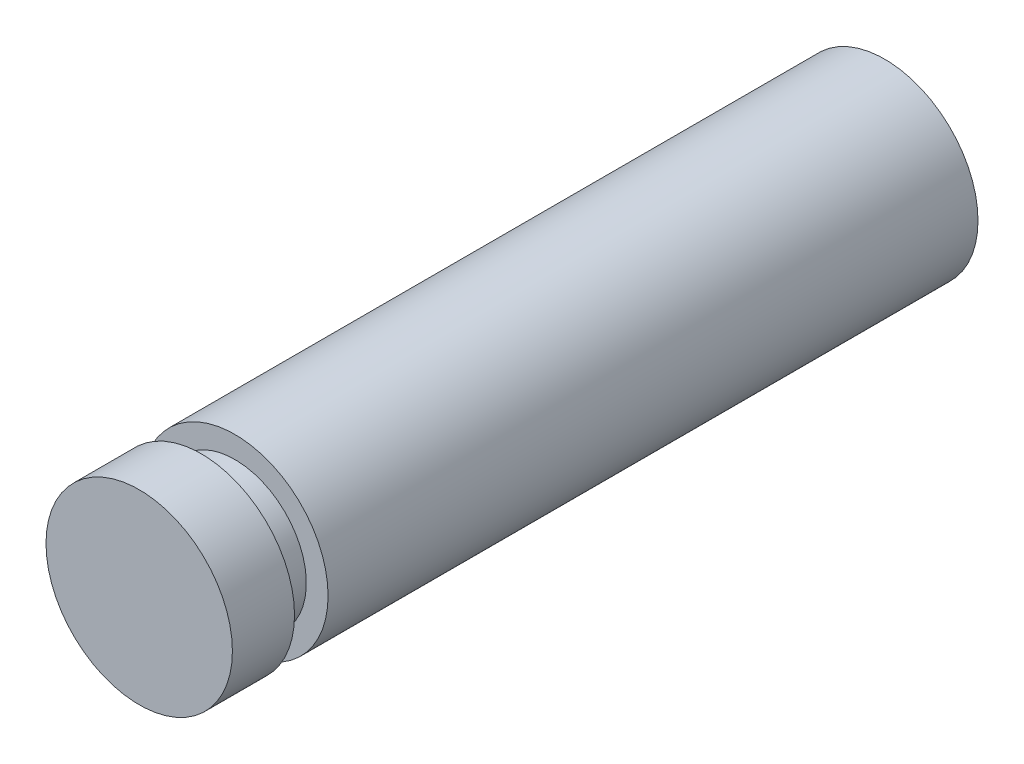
ISO-10303-21;
HEADER;
FILE_DESCRIPTION(('STEP AP214'),'2;1');
FILE_NAME('part.step','',(''),(''),'','','');
FILE_SCHEMA(('AUTOMOTIVE_DESIGN { 1 0 10303 214 1 1 1 1 }'));
ENDSEC;
DATA;
#1=APPLICATION_CONTEXT('core data for automotive mechanical design processes');
#2=APPLICATION_PROTOCOL_DEFINITION('international standard','automotive_design',2000,#1);
#3=PRODUCT_CONTEXT('',#1,'mechanical');
#4=PRODUCT('Part','Part','',(#3));
#5=PRODUCT_RELATED_PRODUCT_CATEGORY('part','',(#4));
#6=PRODUCT_DEFINITION_FORMATION('','',#4);
#7=PRODUCT_DEFINITION_CONTEXT('part definition',#1,'design');
#8=PRODUCT_DEFINITION('design','',#6,#7);
#9=PRODUCT_DEFINITION_SHAPE('','',#8);
#10=(LENGTH_UNIT() NAMED_UNIT(*) SI_UNIT(.MILLI.,.METRE.));
#11=(NAMED_UNIT(*) PLANE_ANGLE_UNIT() SI_UNIT($,.RADIAN.));
#12=(NAMED_UNIT(*) SI_UNIT($,.STERADIAN.) SOLID_ANGLE_UNIT());
#13=UNCERTAINTY_MEASURE_WITH_UNIT(LENGTH_MEASURE(1.E-05),#10,'distance_accuracy_value','');
#14=(GEOMETRIC_REPRESENTATION_CONTEXT(3) GLOBAL_UNCERTAINTY_ASSIGNED_CONTEXT((#13)) GLOBAL_UNIT_ASSIGNED_CONTEXT((#10,
#11,#12)) REPRESENTATION_CONTEXT('',''));
#15=CARTESIAN_POINT('',(0.,0.,0.));
#16=DIRECTION('',(0.,0.,1.));
#17=DIRECTION('',(1.,0.,0.));
#18=AXIS2_PLACEMENT_3D('',#15,#16,#17);
#19=CARTESIAN_POINT('',(0.,0.,12.));
#20=DIRECTION('',(0.,0.,-1.));
#21=DIRECTION('',(-1.,0.,0.));
#22=AXIS2_PLACEMENT_3D('',#19,#20,#21);
#23=CYLINDRICAL_SURFACE('',#22,1.5);
#24=CARTESIAN_POINT('',(0.,0.,12.));
#25=DIRECTION('',(0.,0.,1.));
#26=DIRECTION('',(1.,0.,0.));
#27=AXIS2_PLACEMENT_3D('',#24,#25,#26);
#28=CIRCLE('',#27,1.5);
#29=CARTESIAN_POINT('',(1.5,0.,12.));
#30=VERTEX_POINT('',#29);
#31=EDGE_CURVE('E10',#30,#30,#28,.T.);
#32=ORIENTED_EDGE('',*,*,#31,.F.);
#33=EDGE_LOOP('',(#32));
#34=FACE_BOUND('',#33,.T.);
#35=CARTESIAN_POINT('',(0.,0.,11.));
#36=DIRECTION('',(0.,0.,-1.));
#37=DIRECTION('',(-1.,0.,0.));
#38=AXIS2_PLACEMENT_3D('',#35,#36,#37);
#39=CIRCLE('',#38,1.5);
#40=CARTESIAN_POINT('',(-1.5,0.,11.));
#41=VERTEX_POINT('',#40);
#42=EDGE_CURVE('E33',#41,#41,#39,.T.);
#43=ORIENTED_EDGE('',*,*,#42,.F.);
#44=EDGE_LOOP('',(#43));
#45=FACE_BOUND('',#44,.T.);
#46=ADVANCED_FACE('F30',(#34,#45),#23,.T.);
#47=CARTESIAN_POINT('',(0.,0.,12.));
#48=DIRECTION('',(0.,0.,1.));
#49=DIRECTION('',(1.,0.,0.));
#50=AXIS2_PLACEMENT_3D('',#47,#48,#49);
#51=PLANE('',#50);
#52=ORIENTED_EDGE('',*,*,#31,.T.);
#53=EDGE_LOOP('',(#52));
#54=FACE_BOUND('',#53,.T.);
#55=ADVANCED_FACE('F75',(#54),#51,.T.);
#56=CARTESIAN_POINT('',(1.15,0.,11.));
#57=DIRECTION('',(0.,0.,-1.));
#58=DIRECTION('',(-1.,0.,0.));
#59=AXIS2_PLACEMENT_3D('',#56,#57,#58);
#60=PLANE('',#59);
#61=CARTESIAN_POINT('',(0.,0.,11.));
#62=DIRECTION('',(0.,0.,-1.));
#63=DIRECTION('',(-1.,0.,0.));
#64=AXIS2_PLACEMENT_3D('',#61,#62,#63);
#65=CIRCLE('',#64,1.15);
#66=CARTESIAN_POINT('',(-1.15,0.,11.));
#67=VERTEX_POINT('',#66);
#68=EDGE_CURVE('E44',#67,#67,#65,.T.);
#69=ORIENTED_EDGE('',*,*,#68,.F.);
#70=EDGE_LOOP('',(#69));
#71=FACE_BOUND('',#70,.T.);
#72=ORIENTED_EDGE('',*,*,#42,.T.);
#73=EDGE_LOOP('',(#72));
#74=FACE_BOUND('',#73,.T.);
#75=ADVANCED_FACE('F70',(#71,#74),#60,.T.);
#76=CARTESIAN_POINT('',(1.15,0.,10.46));
#77=DIRECTION('',(0.,0.,1.));
#78=DIRECTION('',(1.,0.,0.));
#79=AXIS2_PLACEMENT_3D('',#76,#77,#78);
#80=PLANE('',#79);
#81=CARTESIAN_POINT('',(0.,0.,10.46));
#82=DIRECTION('',(0.,0.,-1.));
#83=DIRECTION('',(-1.,0.,0.));
#84=AXIS2_PLACEMENT_3D('',#81,#82,#83);
#85=CIRCLE('',#84,1.15);
#86=CARTESIAN_POINT('',(-1.15,0.,10.46));
#87=VERTEX_POINT('',#86);
#88=EDGE_CURVE('E52',#87,#87,#85,.T.);
#89=ORIENTED_EDGE('',*,*,#88,.T.);
#90=EDGE_LOOP('',(#89));
#91=FACE_BOUND('',#90,.T.);
#92=CARTESIAN_POINT('',(0.,0.,10.46));
#93=DIRECTION('',(0.,0.,1.));
#94=DIRECTION('',(1.,0.,0.));
#95=AXIS2_PLACEMENT_3D('',#92,#93,#94);
#96=CIRCLE('',#95,1.5);
#97=CARTESIAN_POINT('',(1.5,0.,10.46));
#98=VERTEX_POINT('',#97);
#99=EDGE_CURVE('E46',#98,#98,#96,.T.);
#100=ORIENTED_EDGE('',*,*,#99,.T.);
#101=EDGE_LOOP('',(#100));
#102=FACE_BOUND('',#101,.T.);
#103=ADVANCED_FACE('F58',(#91,#102),#80,.T.);
#104=CARTESIAN_POINT('',(0.,0.,-1.00720860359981));
#105=DIRECTION('',(0.,0.,-1.));
#106=DIRECTION('',(-1.,0.,0.));
#107=AXIS2_PLACEMENT_3D('',#104,#105,#106);
#108=CYLINDRICAL_SURFACE('',#107,1.15);
#109=ORIENTED_EDGE('',*,*,#68,.T.);
#110=EDGE_LOOP('',(#109));
#111=FACE_BOUND('',#110,.T.);
#112=ORIENTED_EDGE('',*,*,#88,.F.);
#113=EDGE_LOOP('',(#112));
#114=FACE_BOUND('',#113,.T.);
#115=ADVANCED_FACE('F60',(#111,#114),#108,.T.);
#116=CARTESIAN_POINT('',(0.,0.,0.));
#117=DIRECTION('',(0.,0.,1.));
#118=DIRECTION('',(1.,0.,0.));
#119=AXIS2_PLACEMENT_3D('',#116,#117,#118);
#120=PLANE('',#119);
#121=CARTESIAN_POINT('',(0.,0.,0.));
#122=DIRECTION('',(0.,0.,1.));
#123=DIRECTION('',(1.,0.,0.));
#124=AXIS2_PLACEMENT_3D('',#121,#122,#123);
#125=CIRCLE('',#124,1.5);
#126=CARTESIAN_POINT('',(1.5,0.,0.));
#127=VERTEX_POINT('',#126);
#128=EDGE_CURVE('E37',#127,#127,#125,.T.);
#129=ORIENTED_EDGE('',*,*,#128,.F.);
#130=EDGE_LOOP('',(#129));
#131=FACE_BOUND('',#130,.T.);
#132=ADVANCED_FACE('F62',(#131),#120,.F.);
#133=ORIENTED_EDGE('',*,*,#128,.T.);
#134=EDGE_LOOP('',(#133));
#135=FACE_BOUND('',#134,.T.);
#136=ORIENTED_EDGE('',*,*,#99,.F.);
#137=EDGE_LOOP('',(#136));
#138=FACE_BOUND('',#137,.T.);
#139=ADVANCED_FACE('F68',(#135,#138),#23,.T.);
#140=CLOSED_SHELL('',(#46,#55,#75,#103,#115,#132,#139));
#141=MANIFOLD_SOLID_BREP('B2',#140);
#142=ADVANCED_BREP_SHAPE_REPRESENTATION('',(#18,#141),#14);
#143=SHAPE_DEFINITION_REPRESENTATION(#9,#142);
ENDSEC;
END-ISO-10303-21;
